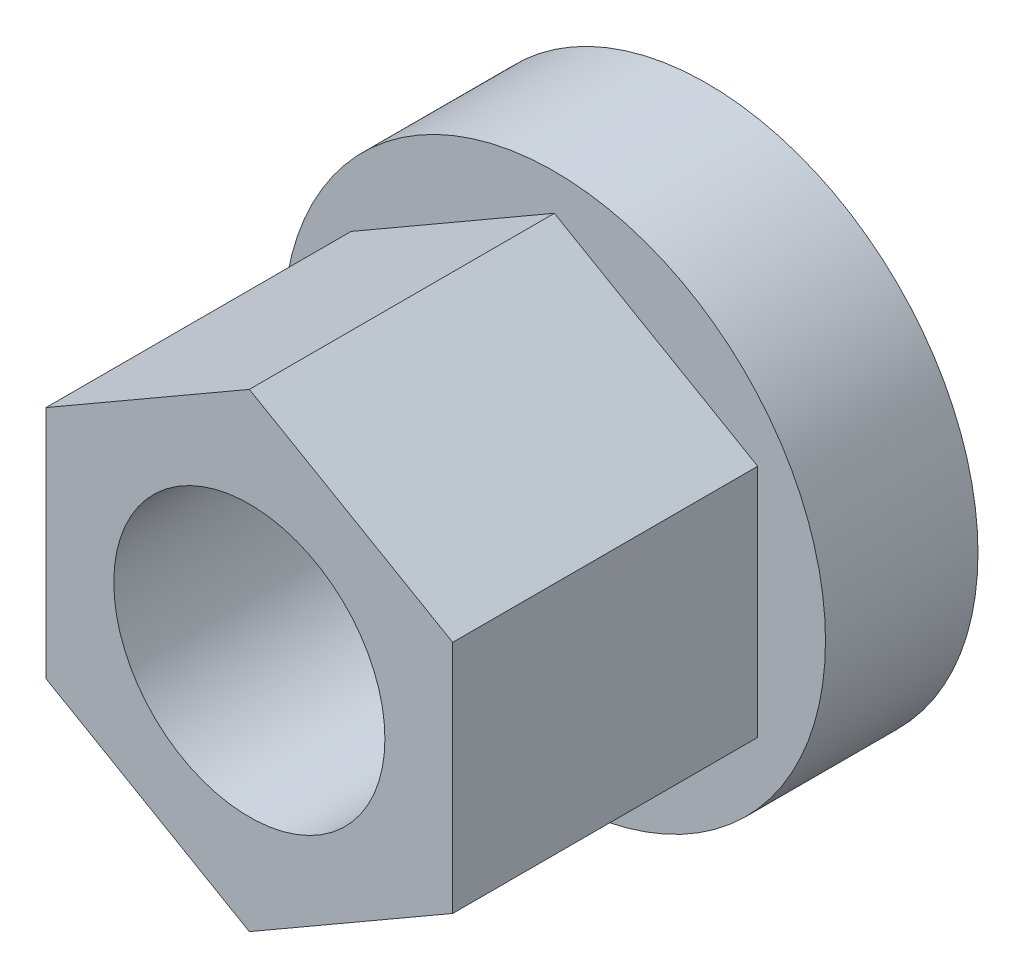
ISO-10303-21;
HEADER;
FILE_DESCRIPTION(('STEP AP214'),'2;1');
FILE_NAME('part.step','',(''),(''),'','','');
FILE_SCHEMA(('AUTOMOTIVE_DESIGN { 1 0 10303 214 1 1 1 1 }'));
ENDSEC;
DATA;
#1=APPLICATION_CONTEXT('core data for automotive mechanical design processes');
#2=APPLICATION_PROTOCOL_DEFINITION('international standard','automotive_design',2000,#1);
#3=PRODUCT_CONTEXT('',#1,'mechanical');
#4=PRODUCT('Part','Part','',(#3));
#5=PRODUCT_RELATED_PRODUCT_CATEGORY('part','',(#4));
#6=PRODUCT_DEFINITION_FORMATION('','',#4);
#7=PRODUCT_DEFINITION_CONTEXT('part definition',#1,'design');
#8=PRODUCT_DEFINITION('design','',#6,#7);
#9=PRODUCT_DEFINITION_SHAPE('','',#8);
#10=(LENGTH_UNIT() NAMED_UNIT(*) SI_UNIT(.MILLI.,.METRE.));
#11=(NAMED_UNIT(*) PLANE_ANGLE_UNIT() SI_UNIT($,.RADIAN.));
#12=(NAMED_UNIT(*) SI_UNIT($,.STERADIAN.) SOLID_ANGLE_UNIT());
#13=UNCERTAINTY_MEASURE_WITH_UNIT(LENGTH_MEASURE(1.E-05),#10,'distance_accuracy_value','');
#14=(GEOMETRIC_REPRESENTATION_CONTEXT(3) GLOBAL_UNCERTAINTY_ASSIGNED_CONTEXT((#13)) GLOBAL_UNIT_ASSIGNED_CONTEXT((#10,
#11,#12)) REPRESENTATION_CONTEXT('',''));
#15=CARTESIAN_POINT('',(0.,0.,0.));
#16=DIRECTION('',(0.,0.,1.));
#17=DIRECTION('',(1.,0.,0.));
#18=AXIS2_PLACEMENT_3D('',#15,#16,#17);
#19=CARTESIAN_POINT('',(-16.,0.,27.));
#20=DIRECTION('',(0.,0.,-1.));
#21=DIRECTION('',(-1.,0.,0.));
#22=AXIS2_PLACEMENT_3D('',#19,#20,#21);
#23=PLANE('',#22);
#24=CARTESIAN_POINT('',(0.,0.,27.));
#25=DIRECTION('',(0.,0.,1.));
#26=DIRECTION('',(1.,0.,0.));
#27=AXIS2_PLACEMENT_3D('',#24,#25,#26);
#28=CIRCLE('',#27,8.);
#29=CARTESIAN_POINT('',(8.,0.,27.));
#30=VERTEX_POINT('',#29);
#31=EDGE_CURVE('E9',#30,#30,#28,.T.);
#32=ORIENTED_EDGE('',*,*,#31,.F.);
#33=EDGE_LOOP('',(#32));
#34=FACE_BOUND('',#33,.T.);
#35=DIRECTION('',(0.86602540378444,-0.5,0.));
#36=VECTOR('',#35,1.);
#37=CARTESIAN_POINT('',(-12.,-6.92820323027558,27.));
#38=LINE('',#37,#36);
#39=CARTESIAN_POINT('',(-12.,-6.92820323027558,27.));
#40=VERTEX_POINT('',#39);
#41=CARTESIAN_POINT('',(0.,-13.856406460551,27.));
#42=VERTEX_POINT('',#41);
#43=EDGE_CURVE('E87',#40,#42,#38,.T.);
#44=ORIENTED_EDGE('',*,*,#43,.T.);
#45=DIRECTION('',(0.866025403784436,0.5,0.));
#46=VECTOR('',#45,1.);
#47=CARTESIAN_POINT('',(0.,-13.8564064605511,27.));
#48=LINE('',#47,#46);
#49=CARTESIAN_POINT('',(12.,-6.92820323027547,27.));
#50=VERTEX_POINT('',#49);
#51=EDGE_CURVE('E85',#42,#50,#48,.T.);
#52=ORIENTED_EDGE('',*,*,#51,.T.);
#53=DIRECTION('',(0.,1.,0.));
#54=VECTOR('',#53,1.);
#55=CARTESIAN_POINT('',(12.,-6.92820323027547,27.));
#56=LINE('',#55,#54);
#57=CARTESIAN_POINT('',(12.,6.92820323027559,27.));
#58=VERTEX_POINT('',#57);
#59=EDGE_CURVE('E29',#50,#58,#56,.T.);
#60=ORIENTED_EDGE('',*,*,#59,.T.);
#61=DIRECTION('',(-0.866025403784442,0.499999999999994,0.));
#62=VECTOR('',#61,1.);
#63=CARTESIAN_POINT('',(12.,6.92820323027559,27.));
#64=LINE('',#63,#62);
#65=CARTESIAN_POINT('',(0.,13.856406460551,27.));
#66=VERTEX_POINT('',#65);
#67=EDGE_CURVE('E75',#58,#66,#64,.T.);
#68=ORIENTED_EDGE('',*,*,#67,.T.);
#69=DIRECTION('',(-0.86602540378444,-0.5,0.));
#70=VECTOR('',#69,1.);
#71=CARTESIAN_POINT('',(0.,13.856406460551,27.));
#72=LINE('',#71,#70);
#73=CARTESIAN_POINT('',(-12.,6.92820323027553,27.));
#74=VERTEX_POINT('',#73);
#75=EDGE_CURVE('E80',#66,#74,#72,.T.);
#76=ORIENTED_EDGE('',*,*,#75,.T.);
#77=DIRECTION('',(0.,-1.,0.));
#78=VECTOR('',#77,1.);
#79=CARTESIAN_POINT('',(-12.,6.92820323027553,27.));
#80=LINE('',#79,#78);
#81=EDGE_CURVE('E108',#74,#40,#80,.T.);
#82=ORIENTED_EDGE('',*,*,#81,.T.);
#83=EDGE_LOOP('',(#44,#52,#60,#68,#76,#82));
#84=FACE_BOUND('',#83,.T.);
#85=ADVANCED_FACE('F14',(#34,#84),#23,.F.);
#86=CARTESIAN_POINT('',(0.,0.,20.));
#87=DIRECTION('',(0.,0.,1.));
#88=DIRECTION('',(1.,0.,0.));
#89=AXIS2_PLACEMENT_3D('',#86,#87,#88);
#90=CYLINDRICAL_SURFACE('',#89,16.);
#91=CARTESIAN_POINT('',(0.,0.,0.));
#92=DIRECTION('',(0.,0.,1.));
#93=DIRECTION('',(1.,0.,0.));
#94=AXIS2_PLACEMENT_3D('',#91,#92,#93);
#95=CIRCLE('',#94,16.);
#96=CARTESIAN_POINT('',(16.,0.,0.));
#97=VERTEX_POINT('',#96);
#98=EDGE_CURVE('E116',#97,#97,#95,.T.);
#99=ORIENTED_EDGE('',*,*,#98,.T.);
#100=EDGE_LOOP('',(#99));
#101=FACE_BOUND('',#100,.T.);
#102=CARTESIAN_POINT('',(0.,0.,9.));
#103=DIRECTION('',(0.,0.,1.));
#104=DIRECTION('',(1.,0.,0.));
#105=AXIS2_PLACEMENT_3D('',#102,#103,#104);
#106=CIRCLE('',#105,16.);
#107=CARTESIAN_POINT('',(16.,0.,9.));
#108=VERTEX_POINT('',#107);
#109=EDGE_CURVE('E17',#108,#108,#106,.T.);
#110=ORIENTED_EDGE('',*,*,#109,.F.);
#111=EDGE_LOOP('',(#110));
#112=FACE_BOUND('',#111,.T.);
#113=ADVANCED_FACE('F127',(#101,#112),#90,.T.);
#114=CARTESIAN_POINT('',(0.,0.,20.));
#115=DIRECTION('',(0.,0.,1.));
#116=DIRECTION('',(1.,0.,0.));
#117=AXIS2_PLACEMENT_3D('',#114,#115,#116);
#118=CYLINDRICAL_SURFACE('',#117,8.);
#119=CARTESIAN_POINT('',(0.,0.,0.));
#120=DIRECTION('',(0.,0.,1.));
#121=DIRECTION('',(1.,0.,0.));
#122=AXIS2_PLACEMENT_3D('',#119,#120,#121);
#123=CIRCLE('',#122,8.);
#124=CARTESIAN_POINT('',(8.,0.,0.));
#125=VERTEX_POINT('',#124);
#126=EDGE_CURVE('E22',#125,#125,#123,.T.);
#127=ORIENTED_EDGE('',*,*,#126,.F.);
#128=EDGE_LOOP('',(#127));
#129=FACE_BOUND('',#128,.T.);
#130=ORIENTED_EDGE('',*,*,#31,.T.);
#131=EDGE_LOOP('',(#130));
#132=FACE_BOUND('',#131,.T.);
#133=ADVANCED_FACE('F124',(#129,#132),#118,.F.);
#134=CARTESIAN_POINT('',(-8.,0.,0.));
#135=DIRECTION('',(0.,0.,1.));
#136=DIRECTION('',(1.,0.,0.));
#137=AXIS2_PLACEMENT_3D('',#134,#135,#136);
#138=PLANE('',#137);
#139=ORIENTED_EDGE('',*,*,#98,.F.);
#140=EDGE_LOOP('',(#139));
#141=FACE_BOUND('',#140,.T.);
#142=ORIENTED_EDGE('',*,*,#126,.T.);
#143=EDGE_LOOP('',(#142));
#144=FACE_BOUND('',#143,.T.);
#145=ADVANCED_FACE('F122',(#141,#144),#138,.F.);
#146=CARTESIAN_POINT('',(0.,0.,9.));
#147=DIRECTION('',(0.,0.,1.));
#148=DIRECTION('',(1.,0.,0.));
#149=AXIS2_PLACEMENT_3D('',#146,#147,#148);
#150=PLANE('',#149);
#151=DIRECTION('',(0.,-1.,0.));
#152=VECTOR('',#151,1.);
#153=CARTESIAN_POINT('',(-12.,6.92820323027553,9.));
#154=LINE('',#153,#152);
#155=CARTESIAN_POINT('',(-12.,6.92820323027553,9.));
#156=VERTEX_POINT('',#155);
#157=CARTESIAN_POINT('',(-12.,-6.92820323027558,9.));
#158=VERTEX_POINT('',#157);
#159=EDGE_CURVE('E92',#156,#158,#154,.T.);
#160=ORIENTED_EDGE('',*,*,#159,.F.);
#161=DIRECTION('',(-0.86602540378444,-0.5,0.));
#162=VECTOR('',#161,1.);
#163=CARTESIAN_POINT('',(0.,13.856406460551,9.));
#164=LINE('',#163,#162);
#165=CARTESIAN_POINT('',(0.,13.856406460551,9.));
#166=VERTEX_POINT('',#165);
#167=EDGE_CURVE('E96',#166,#156,#164,.T.);
#168=ORIENTED_EDGE('',*,*,#167,.F.);
#169=DIRECTION('',(-0.866025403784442,0.499999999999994,0.));
#170=VECTOR('',#169,1.);
#171=CARTESIAN_POINT('',(12.,6.92820323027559,9.));
#172=LINE('',#171,#170);
#173=CARTESIAN_POINT('',(12.,6.92820323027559,9.));
#174=VERTEX_POINT('',#173);
#175=EDGE_CURVE('E99',#174,#166,#172,.T.);
#176=ORIENTED_EDGE('',*,*,#175,.F.);
#177=DIRECTION('',(0.,1.,0.));
#178=VECTOR('',#177,1.);
#179=CARTESIAN_POINT('',(12.,-6.92820323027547,9.));
#180=LINE('',#179,#178);
#181=CARTESIAN_POINT('',(12.,-6.92820323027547,9.));
#182=VERTEX_POINT('',#181);
#183=EDGE_CURVE('E37',#182,#174,#180,.T.);
#184=ORIENTED_EDGE('',*,*,#183,.F.);
#185=DIRECTION('',(0.866025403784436,0.5,0.));
#186=VECTOR('',#185,1.);
#187=CARTESIAN_POINT('',(0.,-13.8564064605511,9.));
#188=LINE('',#187,#186);
#189=CARTESIAN_POINT('',(0.,-13.8564064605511,9.));
#190=VERTEX_POINT('',#189);
#191=EDGE_CURVE('E102',#190,#182,#188,.T.);
#192=ORIENTED_EDGE('',*,*,#191,.F.);
#193=DIRECTION('',(0.86602540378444,-0.5,0.));
#194=VECTOR('',#193,1.);
#195=CARTESIAN_POINT('',(-12.,-6.92820323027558,9.));
#196=LINE('',#195,#194);
#197=EDGE_CURVE('E105',#158,#190,#196,.T.);
#198=ORIENTED_EDGE('',*,*,#197,.F.);
#199=EDGE_LOOP('',(#160,#168,#176,#184,#192,#198));
#200=FACE_BOUND('',#199,.T.);
#201=ORIENTED_EDGE('',*,*,#109,.T.);
#202=EDGE_LOOP('',(#201));
#203=FACE_BOUND('',#202,.T.);
#204=ADVANCED_FACE('F144',(#200,#203),#150,.T.);
#205=CARTESIAN_POINT('',(-12.,-6.92820323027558,9.));
#206=DIRECTION('',(-0.5,-0.86602540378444,0.));
#207=DIRECTION('',(0.86602540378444,-0.5,0.));
#208=AXIS2_PLACEMENT_3D('',#205,#206,#207);
#209=PLANE('',#208);
#210=DIRECTION('',(0.,0.,1.));
#211=VECTOR('',#210,1.);
#212=CARTESIAN_POINT('',(-12.,-6.92820323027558,9.));
#213=LINE('',#212,#211);
#214=EDGE_CURVE('E114',#158,#40,#213,.T.);
#215=ORIENTED_EDGE('',*,*,#214,.F.);
#216=ORIENTED_EDGE('',*,*,#197,.T.);
#217=DIRECTION('',(0.,0.,1.));
#218=VECTOR('',#217,1.);
#219=CARTESIAN_POINT('',(0.,-13.8564064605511,9.));
#220=LINE('',#219,#218);
#221=EDGE_CURVE('E95',#190,#42,#220,.T.);
#222=ORIENTED_EDGE('',*,*,#221,.T.);
#223=ORIENTED_EDGE('',*,*,#43,.F.);
#224=EDGE_LOOP('',(#215,#216,#222,#223));
#225=FACE_BOUND('',#224,.T.);
#226=ADVANCED_FACE('F152',(#225),#209,.T.);
#227=CARTESIAN_POINT('',(-12.,6.92820323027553,9.));
#228=DIRECTION('',(-1.,0.,0.));
#229=DIRECTION('',(0.,-1.,0.));
#230=AXIS2_PLACEMENT_3D('',#227,#228,#229);
#231=PLANE('',#230);
#232=DIRECTION('',(0.,0.,1.));
#233=VECTOR('',#232,1.);
#234=CARTESIAN_POINT('',(-12.,6.92820323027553,9.));
#235=LINE('',#234,#233);
#236=EDGE_CURVE('E112',#156,#74,#235,.T.);
#237=ORIENTED_EDGE('',*,*,#236,.F.);
#238=ORIENTED_EDGE('',*,*,#159,.T.);
#239=ORIENTED_EDGE('',*,*,#214,.T.);
#240=ORIENTED_EDGE('',*,*,#81,.F.);
#241=EDGE_LOOP('',(#237,#238,#239,#240));
#242=FACE_BOUND('',#241,.T.);
#243=ADVANCED_FACE('F158',(#242),#231,.T.);
#244=CARTESIAN_POINT('',(0.,13.856406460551,9.));
#245=DIRECTION('',(-0.5,0.86602540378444,0.));
#246=DIRECTION('',(-0.86602540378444,-0.5,0.));
#247=AXIS2_PLACEMENT_3D('',#244,#245,#246);
#248=PLANE('',#247);
#249=DIRECTION('',(0.,0.,1.));
#250=VECTOR('',#249,1.);
#251=CARTESIAN_POINT('',(0.,13.856406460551,9.));
#252=LINE('',#251,#250);
#253=EDGE_CURVE('E71',#166,#66,#252,.T.);
#254=ORIENTED_EDGE('',*,*,#253,.F.);
#255=ORIENTED_EDGE('',*,*,#167,.T.);
#256=ORIENTED_EDGE('',*,*,#236,.T.);
#257=ORIENTED_EDGE('',*,*,#75,.F.);
#258=EDGE_LOOP('',(#254,#255,#256,#257));
#259=FACE_BOUND('',#258,.T.);
#260=ADVANCED_FACE('F169',(#259),#248,.T.);
#261=CARTESIAN_POINT('',(12.,6.92820323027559,9.));
#262=DIRECTION('',(0.499999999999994,0.866025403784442,0.));
#263=DIRECTION('',(-0.866025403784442,0.5,0.));
#264=AXIS2_PLACEMENT_3D('',#261,#262,#263);
#265=PLANE('',#264);
#266=DIRECTION('',(0.,0.,1.));
#267=VECTOR('',#266,1.);
#268=CARTESIAN_POINT('',(12.,6.92820323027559,9.));
#269=LINE('',#268,#267);
#270=EDGE_CURVE('E66',#174,#58,#269,.T.);
#271=ORIENTED_EDGE('',*,*,#270,.F.);
#272=ORIENTED_EDGE('',*,*,#175,.T.);
#273=ORIENTED_EDGE('',*,*,#253,.T.);
#274=ORIENTED_EDGE('',*,*,#67,.F.);
#275=EDGE_LOOP('',(#271,#272,#273,#274));
#276=FACE_BOUND('',#275,.T.);
#277=ADVANCED_FACE('F76',(#276),#265,.T.);
#278=CARTESIAN_POINT('',(12.,-6.92820323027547,9.));
#279=DIRECTION('',(1.,0.,0.));
#280=DIRECTION('',(0.,1.,0.));
#281=AXIS2_PLACEMENT_3D('',#278,#279,#280);
#282=PLANE('',#281);
#283=DIRECTION('',(0.,0.,1.));
#284=VECTOR('',#283,1.);
#285=CARTESIAN_POINT('',(12.,-6.92820323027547,9.));
#286=LINE('',#285,#284);
#287=EDGE_CURVE('E72',#182,#50,#286,.T.);
#288=ORIENTED_EDGE('',*,*,#287,.F.);
#289=ORIENTED_EDGE('',*,*,#183,.T.);
#290=ORIENTED_EDGE('',*,*,#270,.T.);
#291=ORIENTED_EDGE('',*,*,#59,.F.);
#292=EDGE_LOOP('',(#288,#289,#290,#291));
#293=FACE_BOUND('',#292,.T.);
#294=ADVANCED_FACE('F68',(#293),#282,.T.);
#295=CARTESIAN_POINT('',(0.,-13.8564064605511,9.));
#296=DIRECTION('',(0.5,-0.866025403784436,0.));
#297=DIRECTION('',(0.866025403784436,0.5,0.));
#298=AXIS2_PLACEMENT_3D('',#295,#296,#297);
#299=PLANE('',#298);
#300=ORIENTED_EDGE('',*,*,#191,.T.);
#301=ORIENTED_EDGE('',*,*,#287,.T.);
#302=ORIENTED_EDGE('',*,*,#51,.F.);
#303=ORIENTED_EDGE('',*,*,#221,.F.);
#304=EDGE_LOOP('',(#300,#301,#302,#303));
#305=FACE_BOUND('',#304,.T.);
#306=ADVANCED_FACE('F175',(#305),#299,.T.);
#307=CLOSED_SHELL('',(#85,#113,#133,#145,#204,#226,#243,#260,#277,#294,#306));
#308=MANIFOLD_SOLID_BREP('B1',#307);
#309=ADVANCED_BREP_SHAPE_REPRESENTATION('',(#18,#308),#14);
#310=SHAPE_DEFINITION_REPRESENTATION(#9,#309);
ENDSEC;
END-ISO-10303-21;
